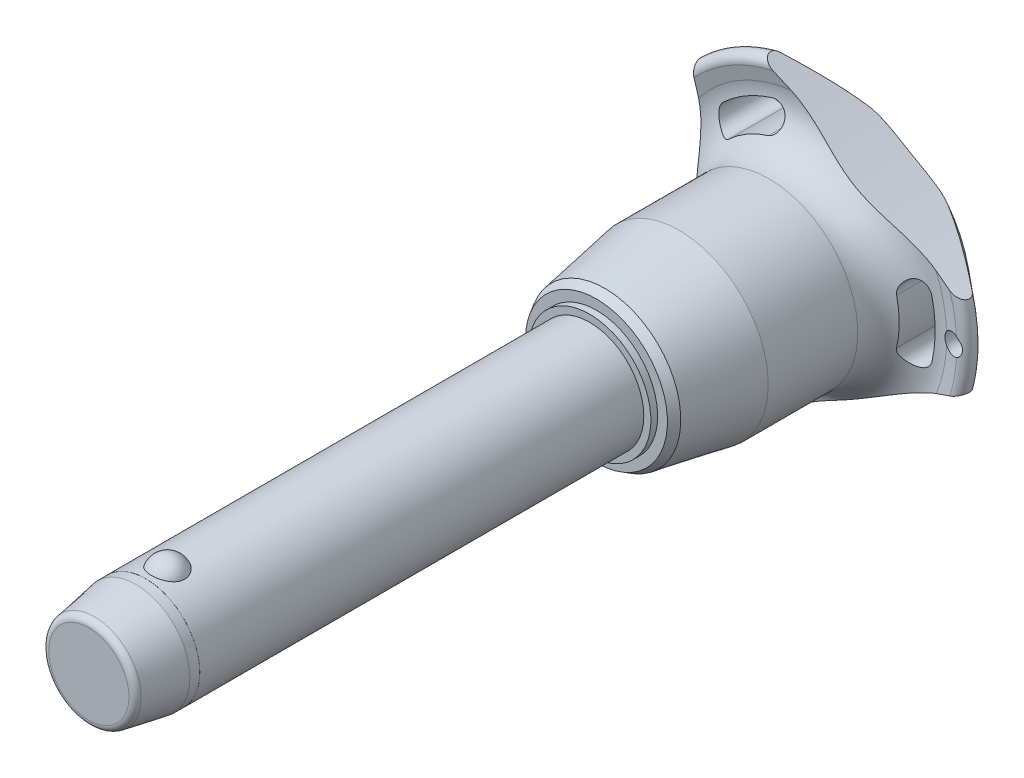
from build123d import *

# Parameters (mm, degrees)
SKETCH1_R           = 8
BOSS_EXTRUDE1_DEPTH = 60
SKETCH2_R           = 7
BOSS_EXTRUDE2_DEPTH = 39.7
BOSS_EXTRUDE3_START = 14
SKETCH1_2_R         = 8
BOSS_EXTRUDE3_DEPTH = 14
CHAMFER1_SIZE       = 7
CHAMFER1_SIZE2      = 1.234288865
FILLET1_R           = 1
SKETCH6_R           = 144.275
CUT_EXTRUDE1_DEPTH  = 106.231005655
CIRPATTERN1_COUNT   = 3
SKETCH7_R           = 1.5
CUT_EXTRUDE2_DEPTH  = 106.040118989
SKETCH8_R           = 8
SKETCH8_R_2         = 7.99
CUT_EXTRUDE3_DEPTH  = 8.4


with BuildPart() as part:
    # Sketch1 → Boss-Extrude1 (new body)
    with BuildSketch(Plane.XY):
        Circle(SKETCH1_R)
    extrude(amount=-BOSS_EXTRUDE1_DEPTH)

    # Sketch2 → Boss-Extrude2 (add)
    with BuildSketch(Plane(origin=(0, 0, -60), x_dir=(-1, 0, 0), z_dir=(0, 0, -1))):
        Circle(SKETCH2_R)
    extrude(amount=BOSS_EXTRUDE2_DEPTH)

    # Sketch3 → Revolve1 (revolve)
    with BuildSketch(Plane(origin=(0, 0, 0), x_dir=(0, 0, -1), z_dir=(1, 0, 0))):
        with BuildLine():
            Line((-2.387467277, 9.5), (-2.387467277, 4.2))
            ThreePointArc((-2.387467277, 4.2), (0.262532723, 6.85), (-2.387467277, 9.5))
        make_face()
        with BuildLine():
            Line((-2.387467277, -4.2), (-2.387467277, -9.5))
            ThreePointArc((-2.387467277, -9.5), (0.262532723, -6.85), (-2.387467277, -4.2))
        make_face()
    revolve(axis=Axis((0, -4.2, 2.387467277), (0, 1, 0)))

    # Sketch1_2 → Boss-Extrude3 (add)
    with BuildSketch(Plane.XY.offset(BOSS_EXTRUDE3_START)):
        Circle(SKETCH1_2_R)
    extrude(amount=-BOSS_EXTRUDE3_DEPTH)

    # Chamfer1
    chamfer1_edges = [part.edges().sort_by_distance(p)[0] for p in [
        (-8, 0, 14),
    ]]
    chamfer1_side = [part.faces().sort_by_distance(p)[0] for p in [
        (-8, 0, -23),
    ]]
    chamfer(chamfer1_edges, length=CHAMFER1_SIZE, length2=CHAMFER1_SIZE2, reference=chamfer1_side[0])

    # Fillet1
    fillet1_edges = [part.edges().sort_by_distance(p)[0] for p in [
        (-6.765711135, 0, 14),
        (7, 0, -99.7),
    ]]
    fillet(fillet1_edges, radius=FILLET1_R)

    # Sketch4 → Revolve2 (revolve)
    with BuildSketch(Plane(origin=(0, 0, 0), x_dir=(0, 0, -1), z_dir=(1, 0, 0)), mode=Mode.PRIVATE) as revolve2_sk:
        Polygon((60, 0), (60, 9.044607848), (61, 9.044607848), (61, 10.490707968), (62.25235944, 11.213758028), (73.233333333, 13.15), (86.466666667, 13.15), (86.466666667, 0), align=None)
    revolve(revolve2_sk.sketch.rotate(Axis((0, 0, -86.466666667), (0, 0, 1)), 90), axis=Axis((0, 0, -86.466666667), (0, 0, 1)))

    # Sketch5 → Revolve3 (revolve)
    with BuildSketch(Plane(origin=(0, 0, 0), x_dir=(0, 0, -1), z_dir=(1, 0, 0)), mode=Mode.PRIVATE) as revolve3_sk:
        with BuildLine():
            Line((92.32877039, 20.428960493), (91.910912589, 22.344207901))
            ThreePointArc((91.910912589, 22.344207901), (92.554394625, 23.677136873), (94.002586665, 23.371345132))
            Line((94.002586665, 23.371345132), (99.141488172, 17.247040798))
            ThreePointArc((99.141488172, 17.247040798), (99.7, 15.584758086), (98.978803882, 13.986322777))
            ThreePointArc((98.978803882, 13.986322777), (94.617427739, 7.589034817), (93.083333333, 0))
            Line((93.083333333, 0), (86.466666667, 0))
            Line((86.466666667, 0), (86.466666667, 13.15))
            ThreePointArc((86.466666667, 13.15), (91.139661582, 15.38660811), (92.32877039, 20.428960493))
        make_face()
    revolve(revolve3_sk.sketch.rotate(Axis((0, 0, -93.083333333), (0, 0, 1)), 90), axis=Axis((0, 0, -93.083333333), (0, 0, 1)))

    # Sketch6 → Cut-Extrude1 (cut, through all)
    with BuildSketch(Plane.XY):
        with Locations((-159.975, 0)):
            Circle(SKETCH6_R)
        with BuildLine():
            ThreePointArc((18.131206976, -4.190753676), (18.60922037, 0), (18.131206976, 4.190753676))
            ThreePointArc((18.131206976, 4.190753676), (15.94840906, 5.553949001), (14.585213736, 3.371151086))
            ThreePointArc((14.585213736, 3.371151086), (14.969740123, 0), (14.585213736, -3.371151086))
            ThreePointArc((14.585213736, -3.371151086), (15.94840906, -5.553949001), (18.131206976, -4.190753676))
        make_face()
    cut_extrude1 = extrude(amount=-CUT_EXTRUDE1_DEPTH, mode=Mode.SUBTRACT)

    # CirPattern1: Cut-Extrude1 ×3 about axis
    cirpattern1_axis = Axis((0, 0, 0), (0, 0, 1))
    for i in range(1, CIRPATTERN1_COUNT):
        add(cut_extrude1.rotate(cirpattern1_axis, i * 360 / CIRPATTERN1_COUNT), mode=Mode.SUBTRACT)

    # Sketch7 → Cut-Extrude2 (cut, through all)
    with BuildSketch(Plane.XY):
        with Locations(Location((21.60922037, 0, 0), (0, 0, 297.620773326))):
            Circle(SKETCH7_R)
    extrude(amount=-CUT_EXTRUDE2_DEPTH, mode=Mode.SUBTRACT)

    # Sketch8 → Cut-Extrude3 (cut)
    with BuildSketch(Plane.XY.offset(14)):
        Circle(SKETCH8_R)
        Circle(SKETCH8_R_2, mode=Mode.SUBTRACT)
    extrude(amount=-CUT_EXTRUDE3_DEPTH, mode=Mode.SUBTRACT)


solid = part.part
